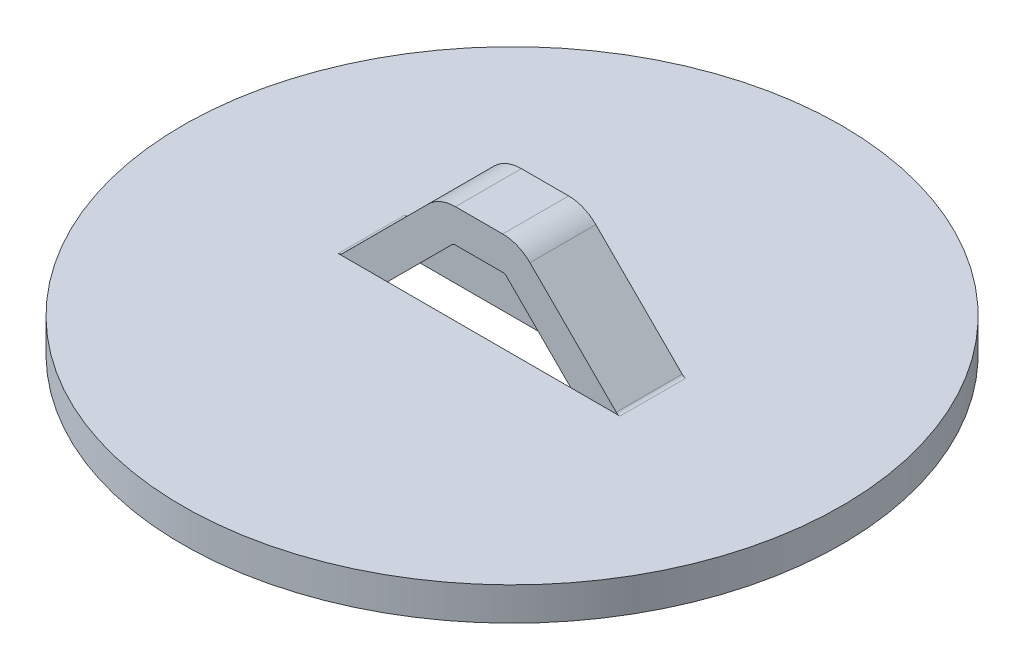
ISO-10303-21;
HEADER;
FILE_DESCRIPTION(('STEP AP214'),'2;1');
FILE_NAME('part.step','',(''),(''),'','','');
FILE_SCHEMA(('AUTOMOTIVE_DESIGN { 1 0 10303 214 1 1 1 1 }'));
ENDSEC;
DATA;
#1=APPLICATION_CONTEXT('core data for automotive mechanical design processes');
#2=APPLICATION_PROTOCOL_DEFINITION('international standard','automotive_design',2000,#1);
#3=PRODUCT_CONTEXT('',#1,'mechanical');
#4=PRODUCT('Part','Part','',(#3));
#5=PRODUCT_RELATED_PRODUCT_CATEGORY('part','',(#4));
#6=PRODUCT_DEFINITION_FORMATION('','',#4);
#7=PRODUCT_DEFINITION_CONTEXT('part definition',#1,'design');
#8=PRODUCT_DEFINITION('design','',#6,#7);
#9=PRODUCT_DEFINITION_SHAPE('','',#8);
#10=(LENGTH_UNIT() NAMED_UNIT(*) SI_UNIT(.MILLI.,.METRE.));
#11=(NAMED_UNIT(*) PLANE_ANGLE_UNIT() SI_UNIT($,.RADIAN.));
#12=(NAMED_UNIT(*) SI_UNIT($,.STERADIAN.) SOLID_ANGLE_UNIT());
#13=UNCERTAINTY_MEASURE_WITH_UNIT(LENGTH_MEASURE(1.E-05),#10,'distance_accuracy_value','');
#14=(GEOMETRIC_REPRESENTATION_CONTEXT(3) GLOBAL_UNCERTAINTY_ASSIGNED_CONTEXT((#13)) GLOBAL_UNIT_ASSIGNED_CONTEXT((#10,
#11,#12)) REPRESENTATION_CONTEXT('',''));
#15=CARTESIAN_POINT('',(0.,0.,0.));
#16=DIRECTION('',(0.,0.,1.));
#17=DIRECTION('',(1.,0.,0.));
#18=AXIS2_PLACEMENT_3D('',#15,#16,#17);
#19=CARTESIAN_POINT('',(-6.78541024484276,0.254,-3.175));
#20=DIRECTION('',(0.,0.,-1.));
#21=DIRECTION('',(-1.,0.,0.));
#22=AXIS2_PLACEMENT_3D('',#19,#20,#21);
#23=PLANE('',#22);
#24=DIRECTION('',(0.707106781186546,0.707106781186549,0.));
#25=VECTOR('',#24,1.);
#26=CARTESIAN_POINT('',(-5.47429285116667,-1.0571173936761,-3.175));
#27=LINE('',#26,#25);
#28=CARTESIAN_POINT('',(-4.41717545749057,0.,-3.175));
#29=VERTEX_POINT('',#28);
#30=CARTESIAN_POINT('',(-1.31657033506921,3.10060512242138,-3.175));
#31=VERTEX_POINT('',#30);
#32=EDGE_CURVE('E230',#29,#31,#27,.T.);
#33=ORIENTED_EDGE('',*,*,#32,.F.);
#34=DIRECTION('',(1.,0.,0.));
#35=VECTOR('',#34,1.);
#36=CARTESIAN_POINT('',(6.78541024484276,0.,-3.175));
#37=LINE('',#36,#35);
#38=CARTESIAN_POINT('',(-6.78541024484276,0.,-3.175));
#39=VERTEX_POINT('',#38);
#40=EDGE_CURVE('E188',#39,#29,#37,.T.);
#41=ORIENTED_EDGE('',*,*,#40,.F.);
#42=CARTESIAN_POINT('',(-6.78541024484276,0.254,-3.175));
#43=DIRECTION('',(0.,0.,1.));
#44=DIRECTION('',(1.,0.,0.));
#45=AXIS2_PLACEMENT_3D('',#42,#43,#44);
#46=CIRCLE('',#45,0.254);
#47=CARTESIAN_POINT('',(-6.60580512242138,0.0743948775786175,-3.175));
#48=VERTEX_POINT('',#47);
#49=EDGE_CURVE('E225',#39,#48,#46,.T.);
#50=ORIENTED_EDGE('',*,*,#49,.T.);
#51=DIRECTION('',(-0.707106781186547,-0.707106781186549,0.));
#52=VECTOR('',#51,1.);
#53=CARTESIAN_POINT('',(-6.60580512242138,0.0743948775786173,-3.175));
#54=LINE('',#53,#52);
#55=CARTESIAN_POINT('',(-2.44808260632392,4.23211739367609,-3.175));
#56=VERTEX_POINT('',#55);
#57=EDGE_CURVE('E127',#56,#48,#54,.T.);
#58=ORIENTED_EDGE('',*,*,#57,.F.);
#59=CARTESIAN_POINT('',(-1.13696521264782,2.921,-3.175));
#60=DIRECTION('',(0.,0.,1.));
#61=DIRECTION('',(1.,0.,0.));
#62=AXIS2_PLACEMENT_3D('',#59,#60,#61);
#63=CIRCLE('',#62,1.8542);
#64=CARTESIAN_POINT('',(-1.13696521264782,4.7752,-3.175));
#65=VERTEX_POINT('',#64);
#66=EDGE_CURVE('E121',#65,#56,#63,.T.);
#67=ORIENTED_EDGE('',*,*,#66,.F.);
#68=DIRECTION('',(1.,0.,0.));
#69=VECTOR('',#68,1.);
#70=CARTESIAN_POINT('',(-1.13696521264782,4.7752,-3.175));
#71=LINE('',#70,#69);
#72=CARTESIAN_POINT('',(1.13696521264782,4.7752,-3.175));
#73=VERTEX_POINT('',#72);
#74=EDGE_CURVE('E217',#73,#65,#71,.F.);
#75=ORIENTED_EDGE('',*,*,#74,.F.);
#76=CARTESIAN_POINT('',(1.13696521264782,2.921,-3.175));
#77=DIRECTION('',(0.,0.,1.));
#78=DIRECTION('',(1.,0.,0.));
#79=AXIS2_PLACEMENT_3D('',#76,#77,#78);
#80=CIRCLE('',#79,1.8542);
#81=CARTESIAN_POINT('',(2.44808260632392,4.23211739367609,-3.175));
#82=VERTEX_POINT('',#81);
#83=EDGE_CURVE('E214',#82,#73,#80,.T.);
#84=ORIENTED_EDGE('',*,*,#83,.F.);
#85=DIRECTION('',(-0.707106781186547,0.707106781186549,0.));
#86=VECTOR('',#85,1.);
#87=CARTESIAN_POINT('',(2.44808260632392,4.23211739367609,-3.175));
#88=LINE('',#87,#86);
#89=CARTESIAN_POINT('',(6.60580512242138,0.0743948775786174,-3.175));
#90=VERTEX_POINT('',#89);
#91=EDGE_CURVE('E193',#90,#82,#88,.T.);
#92=ORIENTED_EDGE('',*,*,#91,.F.);
#93=CARTESIAN_POINT('',(6.78541024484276,0.254,-3.175));
#94=DIRECTION('',(0.,0.,1.));
#95=DIRECTION('',(1.,0.,0.));
#96=AXIS2_PLACEMENT_3D('',#93,#94,#95);
#97=CIRCLE('',#96,0.254);
#98=CARTESIAN_POINT('',(6.78541024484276,0.,-3.175));
#99=VERTEX_POINT('',#98);
#100=EDGE_CURVE('E190',#90,#99,#97,.T.);
#101=ORIENTED_EDGE('',*,*,#100,.T.);
#102=CARTESIAN_POINT('',(4.41717545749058,0.,-3.175));
#103=VERTEX_POINT('',#102);
#104=EDGE_CURVE('E174',#103,#99,#37,.T.);
#105=ORIENTED_EDGE('',*,*,#104,.F.);
#106=DIRECTION('',(0.707106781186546,-0.707106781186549,0.));
#107=VECTOR('',#106,1.);
#108=CARTESIAN_POINT('',(1.3165703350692,3.10060512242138,-3.175));
#109=LINE('',#108,#107);
#110=CARTESIAN_POINT('',(1.31657033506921,3.10060512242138,-3.175));
#111=VERTEX_POINT('',#110);
#112=EDGE_CURVE('E235',#111,#103,#109,.T.);
#113=ORIENTED_EDGE('',*,*,#112,.F.);
#114=CARTESIAN_POINT('',(1.13696521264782,2.921,-3.175));
#115=DIRECTION('',(0.,0.,1.));
#116=DIRECTION('',(1.,0.,0.));
#117=AXIS2_PLACEMENT_3D('',#114,#115,#116);
#118=CIRCLE('',#117,0.254);
#119=CARTESIAN_POINT('',(1.13696521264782,3.175,-3.175));
#120=VERTEX_POINT('',#119);
#121=EDGE_CURVE('E234',#111,#120,#118,.T.);
#122=ORIENTED_EDGE('',*,*,#121,.T.);
#123=DIRECTION('',(1.,0.,0.));
#124=VECTOR('',#123,1.);
#125=CARTESIAN_POINT('',(-1.13696521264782,3.175,-3.175));
#126=LINE('',#125,#124);
#127=CARTESIAN_POINT('',(-1.13696521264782,3.175,-3.175));
#128=VERTEX_POINT('',#127);
#129=EDGE_CURVE('E231',#128,#120,#126,.T.);
#130=ORIENTED_EDGE('',*,*,#129,.F.);
#131=CARTESIAN_POINT('',(-1.13696521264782,2.921,-3.175));
#132=DIRECTION('',(0.,0.,1.));
#133=DIRECTION('',(1.,0.,0.));
#134=AXIS2_PLACEMENT_3D('',#131,#132,#133);
#135=CIRCLE('',#134,0.254);
#136=EDGE_CURVE('E274',#128,#31,#135,.T.);
#137=ORIENTED_EDGE('',*,*,#136,.T.);
#138=EDGE_LOOP('',(#33,#41,#50,#58,#67,#75,#84,#92,#101,#105,#113,#122,#130,#137));
#139=FACE_BOUND('',#138,.T.);
#140=ADVANCED_FACE('F39',(#139),#23,.T.);
#141=CARTESIAN_POINT('',(-6.78541024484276,0.254,0.));
#142=DIRECTION('',(0.,0.,-1.));
#143=DIRECTION('',(-1.,0.,0.));
#144=AXIS2_PLACEMENT_3D('',#141,#142,#143);
#145=PLANE('',#144);
#146=DIRECTION('',(-1.,0.,0.));
#147=VECTOR('',#146,1.);
#148=CARTESIAN_POINT('',(-6.78541024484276,0.,0.));
#149=LINE('',#148,#147);
#150=CARTESIAN_POINT('',(-4.41717545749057,0.,0.));
#151=VERTEX_POINT('',#150);
#152=CARTESIAN_POINT('',(-6.78541024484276,0.,0.));
#153=VERTEX_POINT('',#152);
#154=EDGE_CURVE('E11',#151,#153,#149,.T.);
#155=ORIENTED_EDGE('',*,*,#154,.F.);
#156=DIRECTION('',(-0.707106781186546,-0.707106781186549,0.));
#157=VECTOR('',#156,1.);
#158=CARTESIAN_POINT('',(-1.31657033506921,3.10060512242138,0.));
#159=LINE('',#158,#157);
#160=CARTESIAN_POINT('',(-1.31657033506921,3.10060512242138,0.));
#161=VERTEX_POINT('',#160);
#162=EDGE_CURVE('E243',#161,#151,#159,.T.);
#163=ORIENTED_EDGE('',*,*,#162,.F.);
#164=CARTESIAN_POINT('',(-1.13696521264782,2.921,0.));
#165=DIRECTION('',(0.,0.,1.));
#166=DIRECTION('',(1.,0.,0.));
#167=AXIS2_PLACEMENT_3D('',#164,#165,#166);
#168=CIRCLE('',#167,0.254);
#169=CARTESIAN_POINT('',(-1.13696521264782,3.175,0.));
#170=VERTEX_POINT('',#169);
#171=EDGE_CURVE('E244',#170,#161,#168,.T.);
#172=ORIENTED_EDGE('',*,*,#171,.F.);
#173=DIRECTION('',(-1.,0.,0.));
#174=VECTOR('',#173,1.);
#175=CARTESIAN_POINT('',(-6.78541024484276,3.175,0.));
#176=LINE('',#175,#174);
#177=CARTESIAN_POINT('',(1.13696521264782,3.175,0.));
#178=VERTEX_POINT('',#177);
#179=EDGE_CURVE('E248',#178,#170,#176,.T.);
#180=ORIENTED_EDGE('',*,*,#179,.F.);
#181=CARTESIAN_POINT('',(1.13696521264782,2.921,0.));
#182=DIRECTION('',(0.,0.,1.));
#183=DIRECTION('',(1.,0.,0.));
#184=AXIS2_PLACEMENT_3D('',#181,#182,#183);
#185=CIRCLE('',#184,0.254);
#186=CARTESIAN_POINT('',(1.3165703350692,3.10060512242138,0.));
#187=VERTEX_POINT('',#186);
#188=EDGE_CURVE('E249',#187,#178,#185,.T.);
#189=ORIENTED_EDGE('',*,*,#188,.F.);
#190=DIRECTION('',(-0.707106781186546,0.707106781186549,0.));
#191=VECTOR('',#190,1.);
#192=CARTESIAN_POINT('',(5.47429285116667,-1.05711739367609,0.));
#193=LINE('',#192,#191);
#194=CARTESIAN_POINT('',(4.41717545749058,0.,0.));
#195=VERTEX_POINT('',#194);
#196=EDGE_CURVE('E255',#195,#187,#193,.T.);
#197=ORIENTED_EDGE('',*,*,#196,.F.);
#198=DIRECTION('',(-1.,0.,0.));
#199=VECTOR('',#198,1.);
#200=CARTESIAN_POINT('',(6.78541024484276,0.,0.));
#201=LINE('',#200,#199);
#202=CARTESIAN_POINT('',(6.78541024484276,0.,0.));
#203=VERTEX_POINT('',#202);
#204=EDGE_CURVE('E569',#203,#195,#201,.T.);
#205=ORIENTED_EDGE('',*,*,#204,.F.);
#206=CARTESIAN_POINT('',(6.78541024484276,0.254,0.));
#207=DIRECTION('',(0.,0.,1.));
#208=DIRECTION('',(1.,0.,0.));
#209=AXIS2_PLACEMENT_3D('',#206,#207,#208);
#210=CIRCLE('',#209,0.254);
#211=CARTESIAN_POINT('',(6.60580512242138,0.0743948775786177,0.));
#212=VERTEX_POINT('',#211);
#213=EDGE_CURVE('E200',#212,#203,#210,.T.);
#214=ORIENTED_EDGE('',*,*,#213,.F.);
#215=DIRECTION('',(0.707106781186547,-0.707106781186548,0.));
#216=VECTOR('',#215,1.);
#217=CARTESIAN_POINT('',(2.44808260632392,4.23211739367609,0.));
#218=LINE('',#217,#216);
#219=CARTESIAN_POINT('',(2.44808260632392,4.23211739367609,0.));
#220=VERTEX_POINT('',#219);
#221=EDGE_CURVE('E257',#220,#212,#218,.T.);
#222=ORIENTED_EDGE('',*,*,#221,.F.);
#223=CARTESIAN_POINT('',(1.13696521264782,2.921,0.));
#224=DIRECTION('',(0.,0.,1.));
#225=DIRECTION('',(1.,0.,0.));
#226=AXIS2_PLACEMENT_3D('',#223,#224,#225);
#227=CIRCLE('',#226,1.8542);
#228=CARTESIAN_POINT('',(1.13696521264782,4.7752,0.));
#229=VERTEX_POINT('',#228);
#230=EDGE_CURVE('E258',#229,#220,#227,.F.);
#231=ORIENTED_EDGE('',*,*,#230,.F.);
#232=DIRECTION('',(-1.,0.,0.));
#233=VECTOR('',#232,1.);
#234=CARTESIAN_POINT('',(-6.78541024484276,4.7752,0.));
#235=LINE('',#234,#233);
#236=CARTESIAN_POINT('',(-1.13696521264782,4.7752,0.));
#237=VERTEX_POINT('',#236);
#238=EDGE_CURVE('E261',#237,#229,#235,.F.);
#239=ORIENTED_EDGE('',*,*,#238,.F.);
#240=CARTESIAN_POINT('',(-1.13696521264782,2.921,0.));
#241=DIRECTION('',(0.,0.,1.));
#242=DIRECTION('',(1.,0.,0.));
#243=AXIS2_PLACEMENT_3D('',#240,#241,#242);
#244=CIRCLE('',#243,1.8542);
#245=CARTESIAN_POINT('',(-2.44808260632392,4.23211739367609,0.));
#246=VERTEX_POINT('',#245);
#247=EDGE_CURVE('E262',#246,#237,#244,.F.);
#248=ORIENTED_EDGE('',*,*,#247,.F.);
#249=DIRECTION('',(0.707106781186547,0.707106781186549,0.));
#250=VECTOR('',#249,1.);
#251=CARTESIAN_POINT('',(-6.60580512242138,0.0743948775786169,0.));
#252=LINE('',#251,#250);
#253=CARTESIAN_POINT('',(-6.60580512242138,0.0743948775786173,0.));
#254=VERTEX_POINT('',#253);
#255=EDGE_CURVE('E265',#254,#246,#252,.T.);
#256=ORIENTED_EDGE('',*,*,#255,.F.);
#257=CARTESIAN_POINT('',(-6.78541024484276,0.254,0.));
#258=DIRECTION('',(0.,0.,1.));
#259=DIRECTION('',(1.,0.,0.));
#260=AXIS2_PLACEMENT_3D('',#257,#258,#259);
#261=CIRCLE('',#260,0.254);
#262=EDGE_CURVE('E266',#153,#254,#261,.T.);
#263=ORIENTED_EDGE('',*,*,#262,.F.);
#264=EDGE_LOOP('',(#155,#163,#172,#180,#189,#197,#205,#214,#222,#231,#239,#248,#256,#263));
#265=FACE_BOUND('',#264,.T.);
#266=ADVANCED_FACE('F294',(#265),#145,.F.);
#267=CARTESIAN_POINT('',(-6.78541024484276,0.254,-3.175));
#268=DIRECTION('',(0.,0.,1.));
#269=DIRECTION('',(1.,0.,0.));
#270=AXIS2_PLACEMENT_3D('',#267,#268,#269);
#271=CYLINDRICAL_SURFACE('',#270,0.254);
#272=DIRECTION('',(0.,0.,1.));
#273=VECTOR('',#272,1.);
#274=CARTESIAN_POINT('',(-6.60580512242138,0.0743948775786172,-3.175));
#275=LINE('',#274,#273);
#276=EDGE_CURVE('E220',#48,#254,#275,.T.);
#277=ORIENTED_EDGE('',*,*,#276,.F.);
#278=ORIENTED_EDGE('',*,*,#49,.F.);
#279=DIRECTION('',(0.,0.,1.));
#280=VECTOR('',#279,1.);
#281=CARTESIAN_POINT('',(-6.78541024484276,0.,-3.175));
#282=LINE('',#281,#280);
#283=EDGE_CURVE('E222',#153,#39,#282,.F.);
#284=ORIENTED_EDGE('',*,*,#283,.F.);
#285=ORIENTED_EDGE('',*,*,#262,.T.);
#286=EDGE_LOOP('',(#277,#278,#284,#285));
#287=FACE_BOUND('',#286,.T.);
#288=ADVANCED_FACE('F286',(#287),#271,.F.);
#289=CARTESIAN_POINT('',(-6.60580512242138,0.0743948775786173,-3.175));
#290=DIRECTION('',(-0.707106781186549,0.707106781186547,0.));
#291=DIRECTION('',(-0.707106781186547,-0.707106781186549,0.));
#292=AXIS2_PLACEMENT_3D('',#289,#290,#291);
#293=PLANE('',#292);
#294=ORIENTED_EDGE('',*,*,#57,.T.);
#295=ORIENTED_EDGE('',*,*,#276,.T.);
#296=ORIENTED_EDGE('',*,*,#255,.T.);
#297=DIRECTION('',(0.,0.,1.));
#298=VECTOR('',#297,1.);
#299=CARTESIAN_POINT('',(-2.44808260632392,4.23211739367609,-3.175));
#300=LINE('',#299,#298);
#301=EDGE_CURVE('E218',#56,#246,#300,.T.);
#302=ORIENTED_EDGE('',*,*,#301,.F.);
#303=EDGE_LOOP('',(#294,#295,#296,#302));
#304=FACE_BOUND('',#303,.T.);
#305=ADVANCED_FACE('F290',(#304),#293,.T.);
#306=CARTESIAN_POINT('',(-1.13696521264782,2.921,-3.175));
#307=DIRECTION('',(0.,0.,1.));
#308=DIRECTION('',(1.,0.,0.));
#309=AXIS2_PLACEMENT_3D('',#306,#307,#308);
#310=CYLINDRICAL_SURFACE('',#309,1.8542);
#311=ORIENTED_EDGE('',*,*,#66,.T.);
#312=ORIENTED_EDGE('',*,*,#301,.T.);
#313=ORIENTED_EDGE('',*,*,#247,.T.);
#314=DIRECTION('',(0.,0.,1.));
#315=VECTOR('',#314,1.);
#316=CARTESIAN_POINT('',(-1.13696521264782,4.7752,-3.175));
#317=LINE('',#316,#315);
#318=EDGE_CURVE('E215',#65,#237,#317,.T.);
#319=ORIENTED_EDGE('',*,*,#318,.F.);
#320=EDGE_LOOP('',(#311,#312,#313,#319));
#321=FACE_BOUND('',#320,.T.);
#322=ADVANCED_FACE('F349',(#321),#310,.T.);
#323=CARTESIAN_POINT('',(-1.13696521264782,4.7752,-3.175));
#324=DIRECTION('',(0.,1.,0.));
#325=DIRECTION('',(0.,0.,1.));
#326=AXIS2_PLACEMENT_3D('',#323,#324,#325);
#327=PLANE('',#326);
#328=ORIENTED_EDGE('',*,*,#74,.T.);
#329=ORIENTED_EDGE('',*,*,#318,.T.);
#330=ORIENTED_EDGE('',*,*,#238,.T.);
#331=DIRECTION('',(0.,0.,1.));
#332=VECTOR('',#331,1.);
#333=CARTESIAN_POINT('',(1.13696521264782,4.7752,-3.175));
#334=LINE('',#333,#332);
#335=EDGE_CURVE('E212',#73,#229,#334,.T.);
#336=ORIENTED_EDGE('',*,*,#335,.F.);
#337=EDGE_LOOP('',(#328,#329,#330,#336));
#338=FACE_BOUND('',#337,.T.);
#339=ADVANCED_FACE('F348',(#338),#327,.T.);
#340=CARTESIAN_POINT('',(1.13696521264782,2.921,-3.175));
#341=DIRECTION('',(0.,0.,1.));
#342=DIRECTION('',(1.,0.,0.));
#343=AXIS2_PLACEMENT_3D('',#340,#341,#342);
#344=CYLINDRICAL_SURFACE('',#343,1.8542);
#345=ORIENTED_EDGE('',*,*,#83,.T.);
#346=ORIENTED_EDGE('',*,*,#335,.T.);
#347=ORIENTED_EDGE('',*,*,#230,.T.);
#348=DIRECTION('',(0.,0.,1.));
#349=VECTOR('',#348,1.);
#350=CARTESIAN_POINT('',(2.44808260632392,4.23211739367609,-3.175));
#351=LINE('',#350,#349);
#352=EDGE_CURVE('E210',#82,#220,#351,.T.);
#353=ORIENTED_EDGE('',*,*,#352,.F.);
#354=EDGE_LOOP('',(#345,#346,#347,#353));
#355=FACE_BOUND('',#354,.T.);
#356=ADVANCED_FACE('F344',(#355),#344,.T.);
#357=CARTESIAN_POINT('',(2.44808260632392,4.23211739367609,-3.175));
#358=DIRECTION('',(0.707106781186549,0.707106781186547,0.));
#359=DIRECTION('',(-0.707106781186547,0.707106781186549,0.));
#360=AXIS2_PLACEMENT_3D('',#357,#358,#359);
#361=PLANE('',#360);
#362=ORIENTED_EDGE('',*,*,#91,.T.);
#363=ORIENTED_EDGE('',*,*,#352,.T.);
#364=ORIENTED_EDGE('',*,*,#221,.T.);
#365=DIRECTION('',(0.,0.,1.));
#366=VECTOR('',#365,1.);
#367=CARTESIAN_POINT('',(6.60580512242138,0.074394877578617,-3.175));
#368=LINE('',#367,#366);
#369=EDGE_CURVE('E196',#212,#90,#368,.F.);
#370=ORIENTED_EDGE('',*,*,#369,.T.);
#371=EDGE_LOOP('',(#362,#363,#364,#370));
#372=FACE_BOUND('',#371,.T.);
#373=ADVANCED_FACE('F339',(#372),#361,.T.);
#374=CARTESIAN_POINT('',(6.78541024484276,0.254,-3.175));
#375=DIRECTION('',(0.,0.,1.));
#376=DIRECTION('',(1.,0.,0.));
#377=AXIS2_PLACEMENT_3D('',#374,#375,#376);
#378=CYLINDRICAL_SURFACE('',#377,0.254);
#379=DIRECTION('',(0.,0.,1.));
#380=VECTOR('',#379,1.);
#381=CARTESIAN_POINT('',(6.78541024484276,0.,-3.175));
#382=LINE('',#381,#380);
#383=EDGE_CURVE('E180',#99,#203,#382,.T.);
#384=ORIENTED_EDGE('',*,*,#383,.F.);
#385=ORIENTED_EDGE('',*,*,#100,.F.);
#386=ORIENTED_EDGE('',*,*,#369,.F.);
#387=ORIENTED_EDGE('',*,*,#213,.T.);
#388=EDGE_LOOP('',(#384,#385,#386,#387));
#389=FACE_BOUND('',#388,.T.);
#390=ADVANCED_FACE('F198',(#389),#378,.F.);
#391=CARTESIAN_POINT('',(6.78541024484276,0.,-3.175));
#392=DIRECTION('',(0.,1.,0.));
#393=DIRECTION('',(0.,0.,1.));
#394=AXIS2_PLACEMENT_3D('',#391,#392,#393);
#395=PLANE('',#394);
#396=ORIENTED_EDGE('',*,*,#104,.T.);
#397=ORIENTED_EDGE('',*,*,#383,.T.);
#398=ORIENTED_EDGE('',*,*,#204,.T.);
#399=EDGE_CURVE('E572',#195,#151,#201,.T.);
#400=ORIENTED_EDGE('',*,*,#399,.T.);
#401=ORIENTED_EDGE('',*,*,#154,.T.);
#402=ORIENTED_EDGE('',*,*,#283,.T.);
#403=ORIENTED_EDGE('',*,*,#40,.T.);
#404=EDGE_CURVE('E183',#29,#103,#37,.T.);
#405=ORIENTED_EDGE('',*,*,#404,.T.);
#406=EDGE_LOOP('',(#396,#397,#398,#400,#401,#402,#403,#405));
#407=FACE_BOUND('',#406,.T.);
#408=CARTESIAN_POINT('',(0.,0.,-1.5875));
#409=DIRECTION('',(0.,-1.,0.));
#410=DIRECTION('',(0.,0.,-1.));
#411=AXIS2_PLACEMENT_3D('',#408,#409,#410);
#412=CIRCLE('',#411,15.875);
#413=CARTESIAN_POINT('',(0.,0.,-17.4625));
#414=VERTEX_POINT('',#413);
#415=EDGE_CURVE('E567',#414,#414,#412,.T.);
#416=ORIENTED_EDGE('',*,*,#415,.F.);
#417=EDGE_LOOP('',(#416));
#418=FACE_BOUND('',#417,.T.);
#419=ADVANCED_FACE('F176',(#407,#418),#395,.T.);
#420=CARTESIAN_POINT('',(6.78541024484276,0.254,-3.175));
#421=DIRECTION('',(0.,0.,1.));
#422=DIRECTION('',(1.,0.,0.));
#423=AXIS2_PLACEMENT_3D('',#420,#421,#422);
#424=CYLINDRICAL_SURFACE('',#423,1.8542);
#425=CARTESIAN_POINT('',(6.78541024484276,0.254,-3.175));
#426=DIRECTION('',(0.,0.,1.));
#427=DIRECTION('',(1.,0.,0.));
#428=AXIS2_PLACEMENT_3D('',#425,#426,#427);
#429=CIRCLE('',#428,1.8542);
#430=CARTESIAN_POINT('',(5.47429285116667,-1.05711739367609,-3.175));
#431=VERTEX_POINT('',#430);
#432=CARTESIAN_POINT('',(6.78541024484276,-1.6002,-3.175));
#433=VERTEX_POINT('',#432);
#434=EDGE_CURVE('E201',#431,#433,#429,.T.);
#435=ORIENTED_EDGE('',*,*,#434,.T.);
#436=DIRECTION('',(0.,0.,1.));
#437=VECTOR('',#436,1.);
#438=CARTESIAN_POINT('',(6.78541024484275,-1.6002,-3.175));
#439=LINE('',#438,#437);
#440=CARTESIAN_POINT('',(6.78541024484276,-1.6002,0.));
#441=VERTEX_POINT('',#440);
#442=EDGE_CURVE('E204',#433,#441,#439,.T.);
#443=ORIENTED_EDGE('',*,*,#442,.T.);
#444=CARTESIAN_POINT('',(6.78541024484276,0.254,0.));
#445=DIRECTION('',(0.,0.,1.));
#446=DIRECTION('',(1.,0.,0.));
#447=AXIS2_PLACEMENT_3D('',#444,#445,#446);
#448=CIRCLE('',#447,1.8542);
#449=CARTESIAN_POINT('',(5.47429285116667,-1.05711739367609,0.));
#450=VERTEX_POINT('',#449);
#451=EDGE_CURVE('E252',#441,#450,#448,.F.);
#452=ORIENTED_EDGE('',*,*,#451,.T.);
#453=DIRECTION('',(0.,0.,1.));
#454=VECTOR('',#453,1.);
#455=CARTESIAN_POINT('',(5.47429285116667,-1.05711739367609,-3.175));
#456=LINE('',#455,#454);
#457=EDGE_CURVE('E237',#431,#450,#456,.T.);
#458=ORIENTED_EDGE('',*,*,#457,.F.);
#459=EDGE_LOOP('',(#435,#443,#452,#458));
#460=FACE_BOUND('',#459,.T.);
#461=ADVANCED_FACE('F315',(#460),#424,.T.);
#462=CARTESIAN_POINT('',(1.3165703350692,3.10060512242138,-3.175));
#463=DIRECTION('',(-0.707106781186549,-0.707106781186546,0.));
#464=DIRECTION('',(0.707106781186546,-0.707106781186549,0.));
#465=AXIS2_PLACEMENT_3D('',#462,#463,#464);
#466=PLANE('',#465);
#467=ORIENTED_EDGE('',*,*,#112,.T.);
#468=DIRECTION('',(0.707106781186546,-0.707106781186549,0.));
#469=VECTOR('',#468,1.);
#470=CARTESIAN_POINT('',(1.3165703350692,3.10060512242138,-3.175));
#471=LINE('',#470,#469);
#472=EDGE_CURVE('E226',#103,#431,#471,.T.);
#473=ORIENTED_EDGE('',*,*,#472,.T.);
#474=ORIENTED_EDGE('',*,*,#457,.T.);
#475=EDGE_CURVE('E135',#450,#195,#193,.T.);
#476=ORIENTED_EDGE('',*,*,#475,.T.);
#477=ORIENTED_EDGE('',*,*,#196,.T.);
#478=DIRECTION('',(0.,0.,1.));
#479=VECTOR('',#478,1.);
#480=CARTESIAN_POINT('',(1.31657033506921,3.10060512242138,-3.175));
#481=LINE('',#480,#479);
#482=EDGE_CURVE('E279',#187,#111,#481,.F.);
#483=ORIENTED_EDGE('',*,*,#482,.T.);
#484=EDGE_LOOP('',(#467,#473,#474,#476,#477,#483));
#485=FACE_BOUND('',#484,.T.);
#486=ADVANCED_FACE('F312',(#485),#466,.T.);
#487=CARTESIAN_POINT('',(1.13696521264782,2.921,-3.175));
#488=DIRECTION('',(0.,0.,1.));
#489=DIRECTION('',(1.,0.,0.));
#490=AXIS2_PLACEMENT_3D('',#487,#488,#489);
#491=CYLINDRICAL_SURFACE('',#490,0.254);
#492=DIRECTION('',(0.,0.,1.));
#493=VECTOR('',#492,1.);
#494=CARTESIAN_POINT('',(1.13696521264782,3.175,-3.175));
#495=LINE('',#494,#493);
#496=EDGE_CURVE('E233',#120,#178,#495,.T.);
#497=ORIENTED_EDGE('',*,*,#496,.F.);
#498=ORIENTED_EDGE('',*,*,#121,.F.);
#499=ORIENTED_EDGE('',*,*,#482,.F.);
#500=ORIENTED_EDGE('',*,*,#188,.T.);
#501=EDGE_LOOP('',(#497,#498,#499,#500));
#502=FACE_BOUND('',#501,.T.);
#503=ADVANCED_FACE('F388',(#502),#491,.F.);
#504=CARTESIAN_POINT('',(-1.13696521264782,3.175,-3.175));
#505=DIRECTION('',(0.,-1.,0.));
#506=DIRECTION('',(1.,0.,0.));
#507=AXIS2_PLACEMENT_3D('',#504,#505,#506);
#508=PLANE('',#507);
#509=ORIENTED_EDGE('',*,*,#129,.T.);
#510=ORIENTED_EDGE('',*,*,#496,.T.);
#511=ORIENTED_EDGE('',*,*,#179,.T.);
#512=DIRECTION('',(0.,0.,1.));
#513=VECTOR('',#512,1.);
#514=CARTESIAN_POINT('',(-1.13696521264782,3.175,-3.175));
#515=LINE('',#514,#513);
#516=EDGE_CURVE('E277',#170,#128,#515,.F.);
#517=ORIENTED_EDGE('',*,*,#516,.T.);
#518=EDGE_LOOP('',(#509,#510,#511,#517));
#519=FACE_BOUND('',#518,.T.);
#520=ADVANCED_FACE('F384',(#519),#508,.T.);
#521=CARTESIAN_POINT('',(-1.13696521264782,2.921,-3.175));
#522=DIRECTION('',(0.,0.,1.));
#523=DIRECTION('',(1.,0.,0.));
#524=AXIS2_PLACEMENT_3D('',#521,#522,#523);
#525=CYLINDRICAL_SURFACE('',#524,0.254);
#526=DIRECTION('',(0.,0.,1.));
#527=VECTOR('',#526,1.);
#528=CARTESIAN_POINT('',(-1.31657033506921,3.10060512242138,-3.175));
#529=LINE('',#528,#527);
#530=EDGE_CURVE('E55',#31,#161,#529,.T.);
#531=ORIENTED_EDGE('',*,*,#530,.F.);
#532=ORIENTED_EDGE('',*,*,#136,.F.);
#533=ORIENTED_EDGE('',*,*,#516,.F.);
#534=ORIENTED_EDGE('',*,*,#171,.T.);
#535=EDGE_LOOP('',(#531,#532,#533,#534));
#536=FACE_BOUND('',#535,.T.);
#537=ADVANCED_FACE('F381',(#536),#525,.F.);
#538=CARTESIAN_POINT('',(-5.47429285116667,-1.0571173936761,-3.175));
#539=DIRECTION('',(0.707106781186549,-0.707106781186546,0.));
#540=DIRECTION('',(0.707106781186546,0.707106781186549,0.));
#541=AXIS2_PLACEMENT_3D('',#538,#539,#540);
#542=PLANE('',#541);
#543=CARTESIAN_POINT('',(-5.47429285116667,-1.0571173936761,-3.175));
#544=VERTEX_POINT('',#543);
#545=EDGE_CURVE('E227',#544,#29,#27,.T.);
#546=ORIENTED_EDGE('',*,*,#545,.T.);
#547=ORIENTED_EDGE('',*,*,#32,.T.);
#548=ORIENTED_EDGE('',*,*,#530,.T.);
#549=ORIENTED_EDGE('',*,*,#162,.T.);
#550=CARTESIAN_POINT('',(-5.47429285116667,-1.0571173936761,0.));
#551=VERTEX_POINT('',#550);
#552=EDGE_CURVE('E247',#151,#551,#159,.T.);
#553=ORIENTED_EDGE('',*,*,#552,.T.);
#554=DIRECTION('',(0.,0.,1.));
#555=VECTOR('',#554,1.);
#556=CARTESIAN_POINT('',(-5.47429285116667,-1.0571173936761,-3.175));
#557=LINE('',#556,#555);
#558=EDGE_CURVE('E273',#544,#551,#557,.T.);
#559=ORIENTED_EDGE('',*,*,#558,.F.);
#560=EDGE_LOOP('',(#546,#547,#548,#549,#553,#559));
#561=FACE_BOUND('',#560,.T.);
#562=ADVANCED_FACE('F328',(#561),#542,.T.);
#563=CARTESIAN_POINT('',(-6.78541024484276,0.254,-3.175));
#564=DIRECTION('',(0.,0.,1.));
#565=DIRECTION('',(1.,0.,0.));
#566=AXIS2_PLACEMENT_3D('',#563,#564,#565);
#567=CYLINDRICAL_SURFACE('',#566,1.8542);
#568=CARTESIAN_POINT('',(-6.78541024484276,0.254,-3.175));
#569=DIRECTION('',(0.,0.,1.));
#570=DIRECTION('',(1.,0.,0.));
#571=AXIS2_PLACEMENT_3D('',#568,#569,#570);
#572=CIRCLE('',#571,1.8542);
#573=CARTESIAN_POINT('',(-6.78541024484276,-1.6002,-3.175));
#574=VERTEX_POINT('',#573);
#575=EDGE_CURVE('E270',#574,#544,#572,.T.);
#576=ORIENTED_EDGE('',*,*,#575,.T.);
#577=ORIENTED_EDGE('',*,*,#558,.T.);
#578=CARTESIAN_POINT('',(-6.78541024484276,0.254,0.));
#579=DIRECTION('',(0.,0.,1.));
#580=DIRECTION('',(1.,0.,0.));
#581=AXIS2_PLACEMENT_3D('',#578,#579,#580);
#582=CIRCLE('',#581,1.8542);
#583=CARTESIAN_POINT('',(-6.78541024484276,-1.6002,0.));
#584=VERTEX_POINT('',#583);
#585=EDGE_CURVE('E47',#551,#584,#582,.F.);
#586=ORIENTED_EDGE('',*,*,#585,.T.);
#587=DIRECTION('',(0.,0.,-1.));
#588=VECTOR('',#587,1.);
#589=CARTESIAN_POINT('',(-6.78541024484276,-1.6002,-3.175));
#590=LINE('',#589,#588);
#591=EDGE_CURVE('E269',#574,#584,#590,.F.);
#592=ORIENTED_EDGE('',*,*,#591,.F.);
#593=EDGE_LOOP('',(#576,#577,#586,#592));
#594=FACE_BOUND('',#593,.T.);
#595=ADVANCED_FACE('F326',(#594),#567,.T.);
#596=CARTESIAN_POINT('',(-15.875,-1.6002,-3.175));
#597=DIRECTION('',(0.,-1.,0.));
#598=DIRECTION('',(0.,0.,-1.));
#599=AXIS2_PLACEMENT_3D('',#596,#597,#598);
#600=PLANE('',#599);
#601=CARTESIAN_POINT('',(0.,-1.6002,-1.5875));
#602=DIRECTION('',(0.,-1.,0.));
#603=DIRECTION('',(0.,0.,-1.));
#604=AXIS2_PLACEMENT_3D('',#601,#602,#603);
#605=CIRCLE('',#604,15.875);
#606=CARTESIAN_POINT('',(0.,-1.6002,-17.4625));
#607=VERTEX_POINT('',#606);
#608=EDGE_CURVE('E564',#607,#607,#605,.T.);
#609=ORIENTED_EDGE('',*,*,#608,.T.);
#610=EDGE_LOOP('',(#609));
#611=FACE_BOUND('',#610,.T.);
#612=ORIENTED_EDGE('',*,*,#442,.F.);
#613=DIRECTION('',(1.,0.,0.));
#614=VECTOR('',#613,1.);
#615=CARTESIAN_POINT('',(6.78541024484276,-1.6002,-3.175));
#616=LINE('',#615,#614);
#617=EDGE_CURVE('E320',#574,#433,#616,.T.);
#618=ORIENTED_EDGE('',*,*,#617,.F.);
#619=ORIENTED_EDGE('',*,*,#591,.T.);
#620=DIRECTION('',(-1.,0.,0.));
#621=VECTOR('',#620,1.);
#622=CARTESIAN_POINT('',(6.78541024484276,-1.6002,0.));
#623=LINE('',#622,#621);
#624=EDGE_CURVE('E186',#441,#584,#623,.T.);
#625=ORIENTED_EDGE('',*,*,#624,.F.);
#626=EDGE_LOOP('',(#612,#618,#619,#625));
#627=FACE_BOUND('',#626,.T.);
#628=ADVANCED_FACE('F324',(#611,#627),#600,.T.);
#629=CARTESIAN_POINT('',(6.78541024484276,0.,0.));
#630=DIRECTION('',(0.,0.,1.));
#631=DIRECTION('',(1.,0.,0.));
#632=AXIS2_PLACEMENT_3D('',#629,#630,#631);
#633=PLANE('',#632);
#634=ORIENTED_EDGE('',*,*,#451,.F.);
#635=ORIENTED_EDGE('',*,*,#624,.T.);
#636=ORIENTED_EDGE('',*,*,#585,.F.);
#637=ORIENTED_EDGE('',*,*,#552,.F.);
#638=ORIENTED_EDGE('',*,*,#399,.F.);
#639=ORIENTED_EDGE('',*,*,#475,.F.);
#640=EDGE_LOOP('',(#634,#635,#636,#637,#638,#639));
#641=FACE_BOUND('',#640,.T.);
#642=ADVANCED_FACE('F317',(#641),#633,.F.);
#643=CARTESIAN_POINT('',(0.,0.,-1.5875));
#644=DIRECTION('',(0.,-1.,0.));
#645=DIRECTION('',(0.,0.,-1.));
#646=AXIS2_PLACEMENT_3D('',#643,#644,#645);
#647=CYLINDRICAL_SURFACE('',#646,15.875);
#648=ORIENTED_EDGE('',*,*,#608,.F.);
#649=EDGE_LOOP('',(#648));
#650=FACE_BOUND('',#649,.T.);
#651=ORIENTED_EDGE('',*,*,#415,.T.);
#652=EDGE_LOOP('',(#651));
#653=FACE_BOUND('',#652,.T.);
#654=ADVANCED_FACE('F374',(#650,#653),#647,.T.);
#655=CARTESIAN_POINT('',(6.78541024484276,0.,-3.175));
#656=DIRECTION('',(0.,0.,-1.));
#657=DIRECTION('',(-1.,0.,0.));
#658=AXIS2_PLACEMENT_3D('',#655,#656,#657);
#659=PLANE('',#658);
#660=ORIENTED_EDGE('',*,*,#434,.F.);
#661=ORIENTED_EDGE('',*,*,#472,.F.);
#662=ORIENTED_EDGE('',*,*,#404,.F.);
#663=ORIENTED_EDGE('',*,*,#545,.F.);
#664=ORIENTED_EDGE('',*,*,#575,.F.);
#665=ORIENTED_EDGE('',*,*,#617,.T.);
#666=EDGE_LOOP('',(#660,#661,#662,#663,#664,#665));
#667=FACE_BOUND('',#666,.T.);
#668=ADVANCED_FACE('F470',(#667),#659,.F.);
#669=CLOSED_SHELL('',(#140,#266,#288,#305,#322,#339,#356,#373,#390,#419,#461,#486,#503,#520,
#537,#562,#595,#628,#642,#654,#668));
#670=MANIFOLD_SOLID_BREP('B2',#669);
#671=ADVANCED_BREP_SHAPE_REPRESENTATION('',(#18,#670),#14);
#672=SHAPE_DEFINITION_REPRESENTATION(#9,#671);
ENDSEC;
END-ISO-10303-21;
